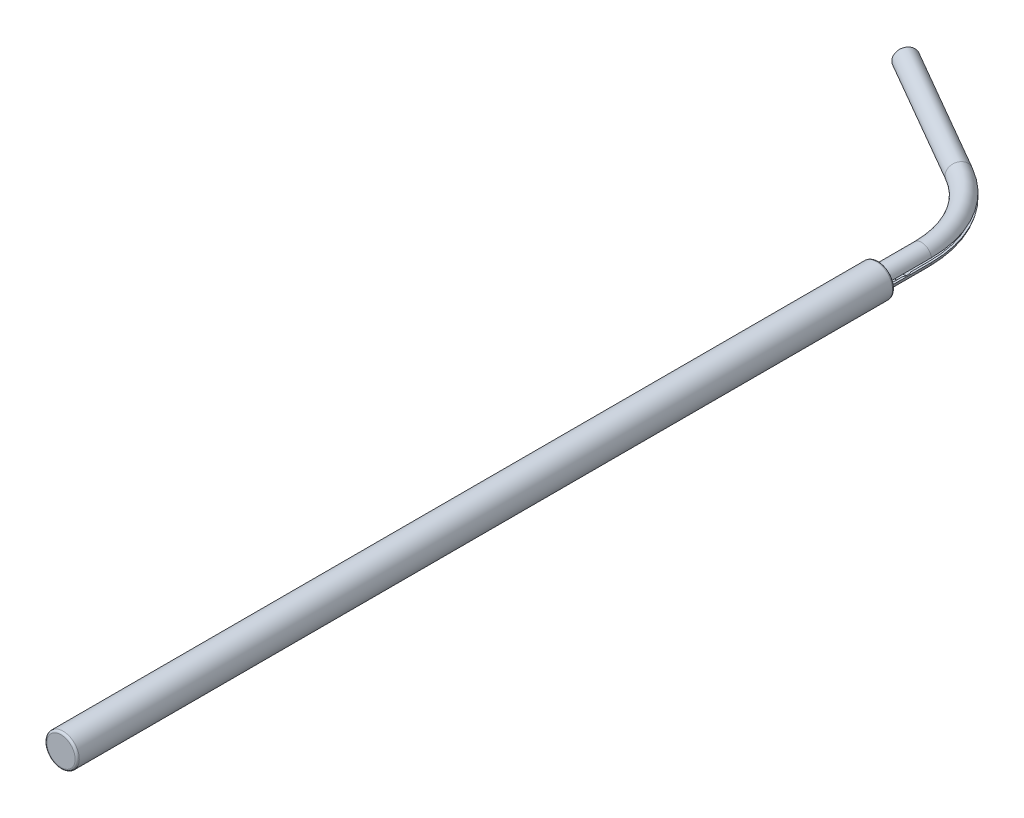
ISO-10303-21;
HEADER;
FILE_DESCRIPTION(('STEP AP214'),'2;1');
FILE_NAME('part.step','',(''),(''),'','','');
FILE_SCHEMA(('AUTOMOTIVE_DESIGN { 1 0 10303 214 1 1 1 1 }'));
ENDSEC;
DATA;
#1=APPLICATION_CONTEXT('core data for automotive mechanical design processes');
#2=APPLICATION_PROTOCOL_DEFINITION('international standard','automotive_design',2000,#1);
#3=PRODUCT_CONTEXT('',#1,'mechanical');
#4=PRODUCT('Part','Part','',(#3));
#5=PRODUCT_RELATED_PRODUCT_CATEGORY('part','',(#4));
#6=PRODUCT_DEFINITION_FORMATION('','',#4);
#7=PRODUCT_DEFINITION_CONTEXT('part definition',#1,'design');
#8=PRODUCT_DEFINITION('design','',#6,#7);
#9=PRODUCT_DEFINITION_SHAPE('','',#8);
#10=(LENGTH_UNIT() NAMED_UNIT(*) SI_UNIT(.MILLI.,.METRE.));
#11=(NAMED_UNIT(*) PLANE_ANGLE_UNIT() SI_UNIT($,.RADIAN.));
#12=(NAMED_UNIT(*) SI_UNIT($,.STERADIAN.) SOLID_ANGLE_UNIT());
#13=UNCERTAINTY_MEASURE_WITH_UNIT(LENGTH_MEASURE(1.E-05),#10,'distance_accuracy_value','');
#14=(GEOMETRIC_REPRESENTATION_CONTEXT(3) GLOBAL_UNCERTAINTY_ASSIGNED_CONTEXT((#13)) GLOBAL_UNIT_ASSIGNED_CONTEXT((#10,
#11,#12)) REPRESENTATION_CONTEXT('',''));
#15=CARTESIAN_POINT('',(0.,0.,0.));
#16=DIRECTION('',(0.,0.,1.));
#17=DIRECTION('',(1.,0.,0.));
#18=AXIS2_PLACEMENT_3D('',#15,#16,#17);
#19=CARTESIAN_POINT('',(0.,0.,-210.566243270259));
#20=DIRECTION('',(0.,0.,1.));
#21=DIRECTION('',(1.,0.,0.));
#22=AXIS2_PLACEMENT_3D('',#19,#20,#21);
#23=CYLINDRICAL_SURFACE('',#22,2.);
#24=DIRECTION('',(0.,0.,1.));
#25=VECTOR('',#24,1.);
#26=CARTESIAN_POINT('',(1.93649167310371,-0.499999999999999,-210.566243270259));
#27=LINE('',#26,#25);
#28=CARTESIAN_POINT('',(1.93649167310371,-0.5,-203.969223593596));
#29=VERTEX_POINT('',#28);
#30=CARTESIAN_POINT('',(1.93649167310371,-0.5,-200.));
#31=VERTEX_POINT('',#30);
#32=EDGE_CURVE('E129',#29,#31,#27,.T.);
#33=ORIENTED_EDGE('',*,*,#32,.F.);
#34=CARTESIAN_POINT('',(0.,0.,-203.969223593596));
#35=DIRECTION('',(0.,0.,-1.00000000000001));
#36=DIRECTION('',(-1.,0.,0.));
#37=AXIS2_PLACEMENT_3D('',#34,#35,#36);
#38=CIRCLE('',#37,2.);
#39=CARTESIAN_POINT('',(1.93649167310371,0.5,-203.969223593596));
#40=VERTEX_POINT('',#39);
#41=EDGE_CURVE('E49',#29,#40,#38,.T.);
#42=ORIENTED_EDGE('',*,*,#41,.T.);
#43=DIRECTION('',(0.,0.,1.));
#44=VECTOR('',#43,1.);
#45=CARTESIAN_POINT('',(1.93649167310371,0.5,-210.566243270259));
#46=LINE('',#45,#44);
#47=CARTESIAN_POINT('',(1.93649167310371,0.5,-200.));
#48=VERTEX_POINT('',#47);
#49=EDGE_CURVE('E128',#40,#48,#46,.T.);
#50=ORIENTED_EDGE('',*,*,#49,.T.);
#51=CARTESIAN_POINT('',(0.,0.,-200.));
#52=DIRECTION('',(0.,0.,1.));
#53=DIRECTION('',(-1.,0.,0.));
#54=AXIS2_PLACEMENT_3D('',#51,#52,#53);
#55=CIRCLE('',#54,2.);
#56=EDGE_CURVE('E264',#48,#31,#55,.T.);
#57=ORIENTED_EDGE('',*,*,#56,.T.);
#58=EDGE_LOOP('',(#33,#42,#50,#57));
#59=FACE_BOUND('',#58,.T.);
#60=ADVANCED_FACE('F34',(#59),#23,.F.);
#61=CARTESIAN_POINT('',(0.,0.,-200.));
#62=DIRECTION('',(0.,0.,1.));
#63=DIRECTION('',(1.,0.,0.));
#64=AXIS2_PLACEMENT_3D('',#61,#62,#63);
#65=PLANE('',#64);
#66=CARTESIAN_POINT('',(0.,0.,-200.));
#67=DIRECTION('',(0.,0.,1.));
#68=DIRECTION('',(1.,0.,0.));
#69=AXIS2_PLACEMENT_3D('',#66,#67,#68);
#70=CIRCLE('',#69,3.46075);
#71=CARTESIAN_POINT('',(3.46075,0.,-200.));
#72=VERTEX_POINT('',#71);
#73=EDGE_CURVE('E42',#72,#72,#70,.F.);
#74=ORIENTED_EDGE('',*,*,#73,.T.);
#75=EDGE_LOOP('',(#74));
#76=FACE_BOUND('',#75,.T.);
#77=CARTESIAN_POINT('',(0.,0.,-200.));
#78=DIRECTION('',(0.,0.,-1.));
#79=DIRECTION('',(-1.,0.,0.));
#80=AXIS2_PLACEMENT_3D('',#77,#78,#79);
#81=CIRCLE('',#80,2.5);
#82=CARTESIAN_POINT('',(2.44948974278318,-0.5,-200.));
#83=VERTEX_POINT('',#82);
#84=CARTESIAN_POINT('',(2.44948974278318,0.5,-200.));
#85=VERTEX_POINT('',#84);
#86=EDGE_CURVE('E56',#83,#85,#81,.T.);
#87=ORIENTED_EDGE('',*,*,#86,.F.);
#88=DIRECTION('',(1.,0.,0.));
#89=VECTOR('',#88,1.);
#90=CARTESIAN_POINT('',(1.93649167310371,-0.5,-200.));
#91=LINE('',#90,#89);
#92=EDGE_CURVE('E255',#31,#83,#91,.T.);
#93=ORIENTED_EDGE('',*,*,#92,.F.);
#94=ORIENTED_EDGE('',*,*,#56,.F.);
#95=DIRECTION('',(-1.,0.,0.));
#96=VECTOR('',#95,1.);
#97=CARTESIAN_POINT('',(2.44948974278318,0.5,-200.));
#98=LINE('',#97,#96);
#99=EDGE_CURVE('E260',#85,#48,#98,.T.);
#100=ORIENTED_EDGE('',*,*,#99,.F.);
#101=EDGE_LOOP('',(#87,#93,#94,#100));
#102=FACE_BOUND('',#101,.T.);
#103=ADVANCED_FACE('F190',(#76,#102),#65,.F.);
#104=CARTESIAN_POINT('',(0.,0.,-200.));
#105=DIRECTION('',(0.,0.,1.));
#106=DIRECTION('',(1.,0.,0.));
#107=AXIS2_PLACEMENT_3D('',#104,#105,#106);
#108=CYLINDRICAL_SURFACE('',#107,3.96875);
#109=CARTESIAN_POINT('',(0.,0.,-0.508000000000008));
#110=DIRECTION('',(0.,0.,1.));
#111=DIRECTION('',(1.,0.,0.));
#112=AXIS2_PLACEMENT_3D('',#109,#110,#111);
#113=CIRCLE('',#112,3.96875);
#114=CARTESIAN_POINT('',(3.96875,0.,-0.508000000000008));
#115=VERTEX_POINT('',#114);
#116=EDGE_CURVE('E185',#115,#115,#113,.F.);
#117=ORIENTED_EDGE('',*,*,#116,.T.);
#118=EDGE_LOOP('',(#117));
#119=FACE_BOUND('',#118,.T.);
#120=CARTESIAN_POINT('',(0.,0.,-199.492));
#121=DIRECTION('',(0.,0.,1.));
#122=DIRECTION('',(1.,0.,0.));
#123=AXIS2_PLACEMENT_3D('',#120,#121,#122);
#124=CIRCLE('',#123,3.96875);
#125=CARTESIAN_POINT('',(3.96875,0.,-199.492));
#126=VERTEX_POINT('',#125);
#127=EDGE_CURVE('E182',#126,#126,#124,.T.);
#128=ORIENTED_EDGE('',*,*,#127,.T.);
#129=EDGE_LOOP('',(#128));
#130=FACE_BOUND('',#129,.T.);
#131=ADVANCED_FACE('F198',(#119,#130),#108,.T.);
#132=CARTESIAN_POINT('',(0.,0.,0.));
#133=DIRECTION('',(0.,0.,1.));
#134=DIRECTION('',(1.,0.,0.));
#135=AXIS2_PLACEMENT_3D('',#132,#133,#134);
#136=PLANE('',#135);
#137=CARTESIAN_POINT('',(0.,0.,0.));
#138=DIRECTION('',(0.,0.,1.));
#139=DIRECTION('',(1.,0.,0.));
#140=AXIS2_PLACEMENT_3D('',#137,#138,#139);
#141=CIRCLE('',#140,3.46075);
#142=CARTESIAN_POINT('',(3.46075,0.,0.));
#143=VERTEX_POINT('',#142);
#144=EDGE_CURVE('E179',#143,#143,#141,.T.);
#145=ORIENTED_EDGE('',*,*,#144,.T.);
#146=EDGE_LOOP('',(#145));
#147=FACE_BOUND('',#146,.T.);
#148=ADVANCED_FACE('F200',(#147),#136,.T.);
#149=CARTESIAN_POINT('',(0.,0.,-0.508000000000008));
#150=DIRECTION('',(0.,0.,1.));
#151=DIRECTION('',(1.,0.,0.));
#152=AXIS2_PLACEMENT_3D('',#149,#150,#151);
#153=TOROIDAL_SURFACE('',#152,3.46075,0.508);
#154=ORIENTED_EDGE('',*,*,#116,.F.);
#155=EDGE_LOOP('',(#154));
#156=FACE_BOUND('',#155,.T.);
#157=ORIENTED_EDGE('',*,*,#144,.F.);
#158=EDGE_LOOP('',(#157));
#159=FACE_BOUND('',#158,.T.);
#160=ADVANCED_FACE('F195',(#156,#159),#153,.T.);
#161=CARTESIAN_POINT('',(0.,0.,-199.492));
#162=DIRECTION('',(0.,0.,1.));
#163=DIRECTION('',(1.,0.,0.));
#164=AXIS2_PLACEMENT_3D('',#161,#162,#163);
#165=TOROIDAL_SURFACE('',#164,3.46075,0.508);
#166=ORIENTED_EDGE('',*,*,#73,.F.);
#167=EDGE_LOOP('',(#166));
#168=FACE_BOUND('',#167,.T.);
#169=ORIENTED_EDGE('',*,*,#127,.F.);
#170=EDGE_LOOP('',(#169));
#171=FACE_BOUND('',#170,.T.);
#172=ADVANCED_FACE('F36',(#168,#171),#165,.T.);
#173=CARTESIAN_POINT('',(-12.5000000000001,0.,-232.21687836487));
#174=DIRECTION('',(-0.86602540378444,0.,-0.499999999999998));
#175=DIRECTION('',(-0.499999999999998,0.,0.86602540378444));
#176=AXIS2_PLACEMENT_3D('',#173,#174,#175);
#177=CYLINDRICAL_SURFACE('',#176,2.);
#178=CARTESIAN_POINT('',(-12.5000000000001,0.,-232.21687836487));
#179=DIRECTION('',(0.86602540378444,0.,0.499999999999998));
#180=DIRECTION('',(-0.499999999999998,0.,0.86602540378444));
#181=AXIS2_PLACEMENT_3D('',#178,#179,#180);
#182=CIRCLE('',#181,2.);
#183=CARTESIAN_POINT('',(-11.5317541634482,0.5,-233.893929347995));
#184=VERTEX_POINT('',#183);
#185=CARTESIAN_POINT('',(-11.5317541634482,-0.499999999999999,-233.893929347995));
#186=VERTEX_POINT('',#185);
#187=EDGE_CURVE('E142',#184,#186,#182,.T.);
#188=ORIENTED_EDGE('',*,*,#187,.T.);
#189=DIRECTION('',(-0.86602540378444,0.,-0.499999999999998));
#190=VECTOR('',#189,1.);
#191=CARTESIAN_POINT('',(-11.5317541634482,-0.499999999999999,-233.893929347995));
#192=LINE('',#191,#190);
#193=CARTESIAN_POINT('',(-42.3330243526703,-0.499999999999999,-251.677050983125));
#194=VERTEX_POINT('',#193);
#195=EDGE_CURVE('E170',#186,#194,#192,.T.);
#196=ORIENTED_EDGE('',*,*,#195,.T.);
#197=CARTESIAN_POINT('',(-43.3012701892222,0.,-250.));
#198=DIRECTION('',(0.86602540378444,0.,0.499999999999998));
#199=DIRECTION('',(-0.499999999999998,0.,0.86602540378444));
#200=AXIS2_PLACEMENT_3D('',#197,#198,#199);
#201=CIRCLE('',#200,2.);
#202=CARTESIAN_POINT('',(-42.3330243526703,0.5,-251.677050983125));
#203=VERTEX_POINT('',#202);
#204=EDGE_CURVE('E161',#203,#194,#201,.T.);
#205=ORIENTED_EDGE('',*,*,#204,.F.);
#206=DIRECTION('',(-0.86602540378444,0.,-0.499999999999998));
#207=VECTOR('',#206,1.);
#208=CARTESIAN_POINT('',(-11.5317541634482,0.5,-233.893929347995));
#209=LINE('',#208,#207);
#210=EDGE_CURVE('E173',#184,#203,#209,.T.);
#211=ORIENTED_EDGE('',*,*,#210,.F.);
#212=EDGE_LOOP('',(#188,#196,#205,#211));
#213=FACE_BOUND('',#212,.T.);
#214=ADVANCED_FACE('F194',(#213),#177,.F.);
#215=CARTESIAN_POINT('',(-12.5000000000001,0.,-232.21687836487));
#216=DIRECTION('',(-0.86602540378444,0.,-0.499999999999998));
#217=DIRECTION('',(-0.499999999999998,0.,0.86602540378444));
#218=AXIS2_PLACEMENT_3D('',#215,#216,#217);
#219=CYLINDRICAL_SURFACE('',#218,2.5);
#220=CARTESIAN_POINT('',(-12.5000000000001,0.,-232.21687836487));
#221=DIRECTION('',(-0.86602540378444,0.,-0.499999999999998));
#222=DIRECTION('',(-0.499999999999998,0.,0.86602540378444));
#223=AXIS2_PLACEMENT_3D('',#220,#221,#222);
#224=CIRCLE('',#223,2.5);
#225=CARTESIAN_POINT('',(-11.2752551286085,-0.5,-234.33819870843));
#226=VERTEX_POINT('',#225);
#227=CARTESIAN_POINT('',(-11.2752551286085,0.5,-234.33819870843));
#228=VERTEX_POINT('',#227);
#229=EDGE_CURVE('E139',#226,#228,#224,.T.);
#230=ORIENTED_EDGE('',*,*,#229,.T.);
#231=DIRECTION('',(-0.86602540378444,0.,-0.499999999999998));
#232=VECTOR('',#231,1.);
#233=CARTESIAN_POINT('',(-11.2752551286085,0.5,-234.33819870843));
#234=LINE('',#233,#232);
#235=CARTESIAN_POINT('',(-42.0765253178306,0.5,-252.12132034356));
#236=VERTEX_POINT('',#235);
#237=EDGE_CURVE('E176',#228,#236,#234,.T.);
#238=ORIENTED_EDGE('',*,*,#237,.T.);
#239=CARTESIAN_POINT('',(-43.3012701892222,0.,-250.));
#240=DIRECTION('',(-0.86602540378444,0.,-0.499999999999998));
#241=DIRECTION('',(-0.499999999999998,0.,0.86602540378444));
#242=AXIS2_PLACEMENT_3D('',#239,#240,#241);
#243=CIRCLE('',#242,2.5);
#244=CARTESIAN_POINT('',(-42.0765253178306,-0.5,-252.12132034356));
#245=VERTEX_POINT('',#244);
#246=EDGE_CURVE('E155',#245,#236,#243,.T.);
#247=ORIENTED_EDGE('',*,*,#246,.F.);
#248=DIRECTION('',(-0.86602540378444,0.,-0.499999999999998));
#249=VECTOR('',#248,1.);
#250=CARTESIAN_POINT('',(-11.2752551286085,-0.5,-234.33819870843));
#251=LINE('',#250,#249);
#252=EDGE_CURVE('E167',#226,#245,#251,.T.);
#253=ORIENTED_EDGE('',*,*,#252,.F.);
#254=EDGE_LOOP('',(#230,#238,#247,#253));
#255=FACE_BOUND('',#254,.T.);
#256=ADVANCED_FACE('F240',(#255),#219,.T.);
#257=CARTESIAN_POINT('',(-25.,0.,-210.566243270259));
#258=DIRECTION('',(0.,1.,0.));
#259=DIRECTION('',(0.,0.,1.));
#260=AXIS2_PLACEMENT_3D('',#257,#258,#259);
#261=TOROIDAL_SURFACE('',#260,25.,2.);
#262=CARTESIAN_POINT('',(0.,0.,-210.566243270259));
#263=DIRECTION('',(0.,0.,1.));
#264=DIRECTION('',(-1.,0.,0.));
#265=AXIS2_PLACEMENT_3D('',#262,#263,#264);
#266=CIRCLE('',#265,2.);
#267=CARTESIAN_POINT('',(1.93649167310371,0.5,-210.566243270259));
#268=VERTEX_POINT('',#267);
#269=CARTESIAN_POINT('',(1.93649167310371,-0.499999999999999,-210.566243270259));
#270=VERTEX_POINT('',#269);
#271=EDGE_CURVE('E250',#268,#270,#266,.T.);
#272=ORIENTED_EDGE('',*,*,#271,.T.);
#273=CARTESIAN_POINT('',(-25.,-0.499999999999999,-210.566243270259));
#274=DIRECTION('',(0.,1.,0.));
#275=DIRECTION('',(0.,0.,1.));
#276=AXIS2_PLACEMENT_3D('',#273,#274,#275);
#277=CIRCLE('',#276,26.9364916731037);
#278=EDGE_CURVE('E126',#270,#186,#277,.T.);
#279=ORIENTED_EDGE('',*,*,#278,.T.);
#280=ORIENTED_EDGE('',*,*,#187,.F.);
#281=CARTESIAN_POINT('',(-25.,0.5,-210.566243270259));
#282=DIRECTION('',(0.,1.,0.));
#283=DIRECTION('',(0.,0.,1.));
#284=AXIS2_PLACEMENT_3D('',#281,#282,#283);
#285=CIRCLE('',#284,26.9364916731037);
#286=EDGE_CURVE('E149',#268,#184,#285,.T.);
#287=ORIENTED_EDGE('',*,*,#286,.F.);
#288=EDGE_LOOP('',(#272,#279,#280,#287));
#289=FACE_BOUND('',#288,.T.);
#290=ADVANCED_FACE('F236',(#289),#261,.F.);
#291=CARTESIAN_POINT('',(-25.,0.,-210.566243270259));
#292=DIRECTION('',(0.,1.,0.));
#293=DIRECTION('',(0.,0.,1.));
#294=AXIS2_PLACEMENT_3D('',#291,#292,#293);
#295=TOROIDAL_SURFACE('',#294,25.,2.5);
#296=CARTESIAN_POINT('',(0.,0.,-210.566243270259));
#297=DIRECTION('',(0.,0.,-1.));
#298=DIRECTION('',(-1.,0.,0.));
#299=AXIS2_PLACEMENT_3D('',#296,#297,#298);
#300=CIRCLE('',#299,2.5);
#301=CARTESIAN_POINT('',(2.44948974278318,-0.5,-210.566243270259));
#302=VERTEX_POINT('',#301);
#303=CARTESIAN_POINT('',(2.44948974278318,0.5,-210.566243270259));
#304=VERTEX_POINT('',#303);
#305=EDGE_CURVE('E251',#302,#304,#300,.T.);
#306=ORIENTED_EDGE('',*,*,#305,.T.);
#307=CARTESIAN_POINT('',(-25.,0.5,-210.566243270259));
#308=DIRECTION('',(0.,1.,0.));
#309=DIRECTION('',(0.,0.,1.));
#310=AXIS2_PLACEMENT_3D('',#307,#308,#309);
#311=CIRCLE('',#310,27.4494897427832);
#312=EDGE_CURVE('E152',#304,#228,#311,.T.);
#313=ORIENTED_EDGE('',*,*,#312,.T.);
#314=ORIENTED_EDGE('',*,*,#229,.F.);
#315=CARTESIAN_POINT('',(-25.,-0.5,-210.566243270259));
#316=DIRECTION('',(0.,1.,0.));
#317=DIRECTION('',(0.,0.,1.));
#318=AXIS2_PLACEMENT_3D('',#315,#316,#317);
#319=CIRCLE('',#318,27.4494897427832);
#320=EDGE_CURVE('E145',#302,#226,#319,.T.);
#321=ORIENTED_EDGE('',*,*,#320,.F.);
#322=EDGE_LOOP('',(#306,#313,#314,#321));
#323=FACE_BOUND('',#322,.T.);
#324=ADVANCED_FACE('F229',(#323),#295,.T.);
#325=CARTESIAN_POINT('',(0.,0.,-210.566243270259));
#326=DIRECTION('',(0.,0.,1.));
#327=DIRECTION('',(1.,0.,0.));
#328=AXIS2_PLACEMENT_3D('',#325,#326,#327);
#329=CYLINDRICAL_SURFACE('',#328,2.5);
#330=ORIENTED_EDGE('',*,*,#86,.T.);
#331=DIRECTION('',(0.,0.,1.));
#332=VECTOR('',#331,1.);
#333=CARTESIAN_POINT('',(2.44948974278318,0.5,-210.566243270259));
#334=LINE('',#333,#332);
#335=EDGE_CURVE('E136',#304,#85,#334,.T.);
#336=ORIENTED_EDGE('',*,*,#335,.F.);
#337=ORIENTED_EDGE('',*,*,#305,.F.);
#338=DIRECTION('',(0.,0.,1.));
#339=VECTOR('',#338,1.);
#340=CARTESIAN_POINT('',(2.44948974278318,-0.5,-210.566243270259));
#341=LINE('',#340,#339);
#342=EDGE_CURVE('E132',#302,#83,#341,.T.);
#343=ORIENTED_EDGE('',*,*,#342,.T.);
#344=EDGE_LOOP('',(#330,#336,#337,#343));
#345=FACE_BOUND('',#344,.T.);
#346=ADVANCED_FACE('F224',(#345),#329,.T.);
#347=CARTESIAN_POINT('',(2.44948974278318,0.5,-210.566243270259));
#348=DIRECTION('',(0.,1.,0.));
#349=DIRECTION('',(-1.,0.,0.));
#350=AXIS2_PLACEMENT_3D('',#347,#348,#349);
#351=PLANE('',#350);
#352=ORIENTED_EDGE('',*,*,#49,.F.);
#353=CARTESIAN_POINT('',(0.,0.499999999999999,-205.));
#354=DIRECTION('',(0.,1.,0.));
#355=DIRECTION('',(-1.,0.,0.));
#356=AXIS2_PLACEMENT_3D('',#353,#354,#355);
#357=CIRCLE('',#356,2.19374109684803);
#358=CARTESIAN_POINT('',(1.93649167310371,0.5,-206.030776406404));
#359=VERTEX_POINT('',#358);
#360=EDGE_CURVE('E261',#40,#359,#357,.T.);
#361=ORIENTED_EDGE('',*,*,#360,.T.);
#362=EDGE_CURVE('E122',#268,#359,#46,.T.);
#363=ORIENTED_EDGE('',*,*,#362,.F.);
#364=ORIENTED_EDGE('',*,*,#286,.T.);
#365=ORIENTED_EDGE('',*,*,#210,.T.);
#366=DIRECTION('',(-0.499999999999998,0.,0.86602540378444));
#367=VECTOR('',#366,1.);
#368=CARTESIAN_POINT('',(-42.0765253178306,0.5,-252.12132034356));
#369=LINE('',#368,#367);
#370=EDGE_CURVE('E164',#236,#203,#369,.T.);
#371=ORIENTED_EDGE('',*,*,#370,.F.);
#372=ORIENTED_EDGE('',*,*,#237,.F.);
#373=ORIENTED_EDGE('',*,*,#312,.F.);
#374=ORIENTED_EDGE('',*,*,#335,.T.);
#375=ORIENTED_EDGE('',*,*,#99,.T.);
#376=EDGE_LOOP('',(#352,#361,#363,#364,#365,#371,#372,#373,#374,#375));
#377=FACE_BOUND('',#376,.T.);
#378=ADVANCED_FACE('F218',(#377),#351,.F.);
#379=ORIENTED_EDGE('',*,*,#362,.T.);
#380=CARTESIAN_POINT('',(0.,0.,-206.030776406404));
#381=DIRECTION('',(0.,0.,1.00000000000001));
#382=DIRECTION('',(1.,0.,0.));
#383=AXIS2_PLACEMENT_3D('',#380,#381,#382);
#384=CIRCLE('',#383,2.);
#385=CARTESIAN_POINT('',(1.93649167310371,-0.5,-206.030776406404));
#386=VERTEX_POINT('',#385);
#387=EDGE_CURVE('E110',#359,#386,#384,.T.);
#388=ORIENTED_EDGE('',*,*,#387,.T.);
#389=EDGE_CURVE('E120',#270,#386,#27,.T.);
#390=ORIENTED_EDGE('',*,*,#389,.F.);
#391=ORIENTED_EDGE('',*,*,#271,.F.);
#392=EDGE_LOOP('',(#379,#388,#390,#391));
#393=FACE_BOUND('',#392,.T.);
#394=ADVANCED_FACE('F118',(#393),#23,.F.);
#395=CARTESIAN_POINT('',(1.93649167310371,-0.5,-210.566243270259));
#396=DIRECTION('',(0.,-1.,0.));
#397=DIRECTION('',(1.,0.,0.));
#398=AXIS2_PLACEMENT_3D('',#395,#396,#397);
#399=PLANE('',#398);
#400=ORIENTED_EDGE('',*,*,#389,.T.);
#401=CARTESIAN_POINT('',(0.,-0.499999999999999,-205.));
#402=DIRECTION('',(0.,-1.,0.));
#403=DIRECTION('',(1.,0.,0.));
#404=AXIS2_PLACEMENT_3D('',#401,#402,#403);
#405=CIRCLE('',#404,2.19374109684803);
#406=EDGE_CURVE('E11',#386,#29,#405,.T.);
#407=ORIENTED_EDGE('',*,*,#406,.T.);
#408=ORIENTED_EDGE('',*,*,#32,.T.);
#409=ORIENTED_EDGE('',*,*,#92,.T.);
#410=ORIENTED_EDGE('',*,*,#342,.F.);
#411=ORIENTED_EDGE('',*,*,#320,.T.);
#412=ORIENTED_EDGE('',*,*,#252,.T.);
#413=DIRECTION('',(0.499999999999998,0.,-0.86602540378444));
#414=VECTOR('',#413,1.);
#415=CARTESIAN_POINT('',(-42.3330243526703,-0.5,-251.677050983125));
#416=LINE('',#415,#414);
#417=EDGE_CURVE('E158',#194,#245,#416,.T.);
#418=ORIENTED_EDGE('',*,*,#417,.F.);
#419=ORIENTED_EDGE('',*,*,#195,.F.);
#420=ORIENTED_EDGE('',*,*,#278,.F.);
#421=EDGE_LOOP('',(#400,#407,#408,#409,#410,#411,#412,#418,#419,#420));
#422=FACE_BOUND('',#421,.T.);
#423=ADVANCED_FACE('F124',(#422),#399,.F.);
#424=CARTESIAN_POINT('',(-43.3012701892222,0.,-250.));
#425=DIRECTION('',(-0.86602540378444,0.,-0.499999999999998));
#426=DIRECTION('',(-0.499999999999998,0.,0.86602540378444));
#427=AXIS2_PLACEMENT_3D('',#424,#425,#426);
#428=PLANE('',#427);
#429=ORIENTED_EDGE('',*,*,#246,.T.);
#430=ORIENTED_EDGE('',*,*,#370,.T.);
#431=ORIENTED_EDGE('',*,*,#204,.T.);
#432=ORIENTED_EDGE('',*,*,#417,.T.);
#433=EDGE_LOOP('',(#429,#430,#431,#432));
#434=FACE_BOUND('',#433,.T.);
#435=ADVANCED_FACE('F223',(#434),#428,.T.);
#436=CARTESIAN_POINT('',(0.,0.,-205.));
#437=DIRECTION('',(0.,-1.,0.));
#438=DIRECTION('',(1.,0.,0.));
#439=AXIS2_PLACEMENT_3D('',#436,#437,#438);
#440=SPHERICAL_SURFACE('',#439,2.25);
#441=ORIENTED_EDGE('',*,*,#41,.F.);
#442=ORIENTED_EDGE('',*,*,#406,.F.);
#443=ORIENTED_EDGE('',*,*,#387,.F.);
#444=ORIENTED_EDGE('',*,*,#360,.F.);
#445=EDGE_LOOP('',(#441,#442,#443,#444));
#446=FACE_BOUND('',#445,.T.);
#447=ADVANCED_FACE('F109',(#446),#440,.F.);
#448=CLOSED_SHELL('',(#60,#103,#131,#148,#160,#172,#214,#256,#290,#324,#346,#378,#394,#423,#435,#447));
#449=MANIFOLD_SOLID_BREP('B2',#448);
#450=ADVANCED_BREP_SHAPE_REPRESENTATION('',(#18,#449),#14);
#451=SHAPE_DEFINITION_REPRESENTATION(#9,#450);
ENDSEC;
END-ISO-10303-21;
